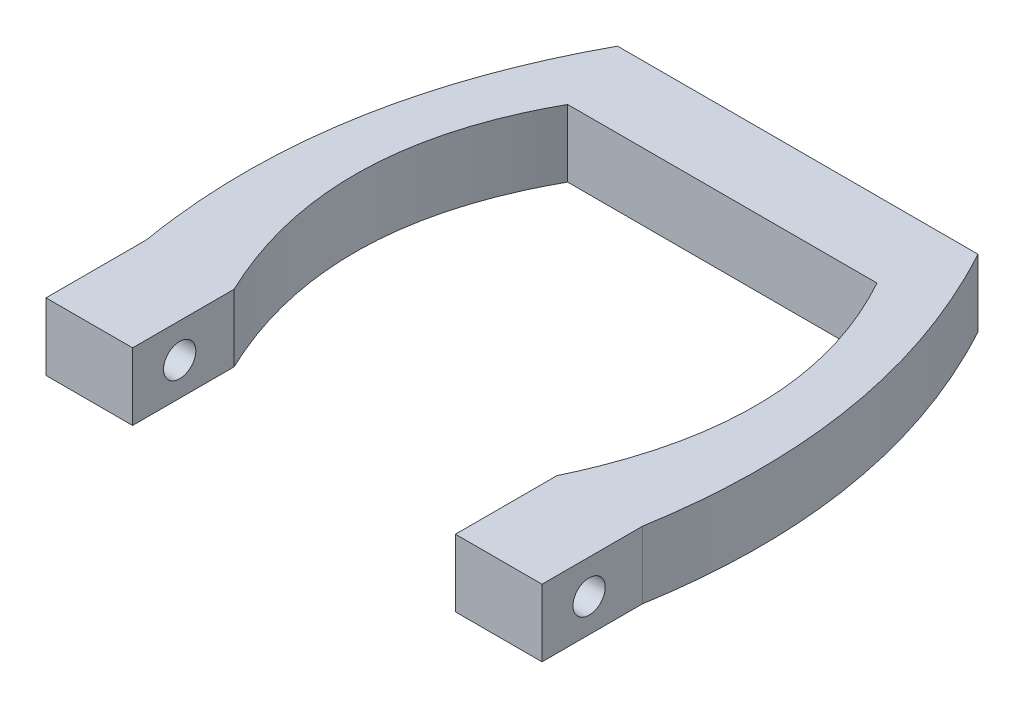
from build123d import *

# Parameters (mm, degrees)
EXTRUDE_1_DEPTH     = 5
SKETCH_2_R          = 1.2
CUT_EXTRUDE_1_DEPTH = 38


with BuildPart() as part:
    # Sketch 1 → Extrude 1 (new body)
    with BuildSketch(Plane(origin=(0, 0, 0), x_dir=(1, 0, 0), z_dir=(0, 1, 0))):
        with BuildLine():
            Line((-20.399767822, -20.11724345), (-13.962053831, -20.11724345))
            Line((-13.962053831, -20.11724345), (-13.962053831, -12.571516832))
            add(Edge.make_bspline(
                [(-13.962053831, -12.571516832), (-19.981617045, -0.010135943), (-13.461461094, 11.724184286)],
                knots=[0, 0, 0, 1, 1, 1], degree=2))
            Line((-13.461461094, 11.724184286), (9.538538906, 11.724184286))
            add(Edge.make_bspline(
                [(10.039131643, -12.571516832), (16.058694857, -0.010135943), (9.538538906, 11.724184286)],
                knots=[0, 0, 0, 1, 1, 1], degree=2))
            Line((10.039131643, -12.571516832), (10.039131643, -20.11724345))
            Line((10.039131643, -20.11724345), (16.476845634, -20.11724345))
            Line((16.476845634, -20.11724345), (16.476845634, -12.640662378))
            add(Edge.make_bspline(
                [(16.476845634, -12.640662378), (19.143008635, 3.16787764), (11.435554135, 17.336746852)],
                knots=[0, 0, 0, 1, 1, 1], degree=2))
            Line((11.435554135, 17.336746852), (-15.358476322, 17.336746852))
            add(Edge.make_bspline(
                [(-20.399767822, -12.640662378), (-23.065930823, 3.16787764), (-15.358476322, 17.336746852)],
                knots=[0, 0, 0, 1, 1, 1], degree=2))
            Line((-20.399767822, -12.640662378), (-20.399767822, -20.11724345))
        make_face()
    extrude(amount=EXTRUDE_1_DEPTH)

    # Sketch 2 → Cut-Extrude 1 (cut)
    with BuildSketch(Plane.ZY.offset(20.399767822)):
        with Locations((16.61724345, 2.460362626)):
            Circle(SKETCH_2_R)
    extrude(amount=-CUT_EXTRUDE_1_DEPTH, mode=Mode.SUBTRACT)


solid = part.part
